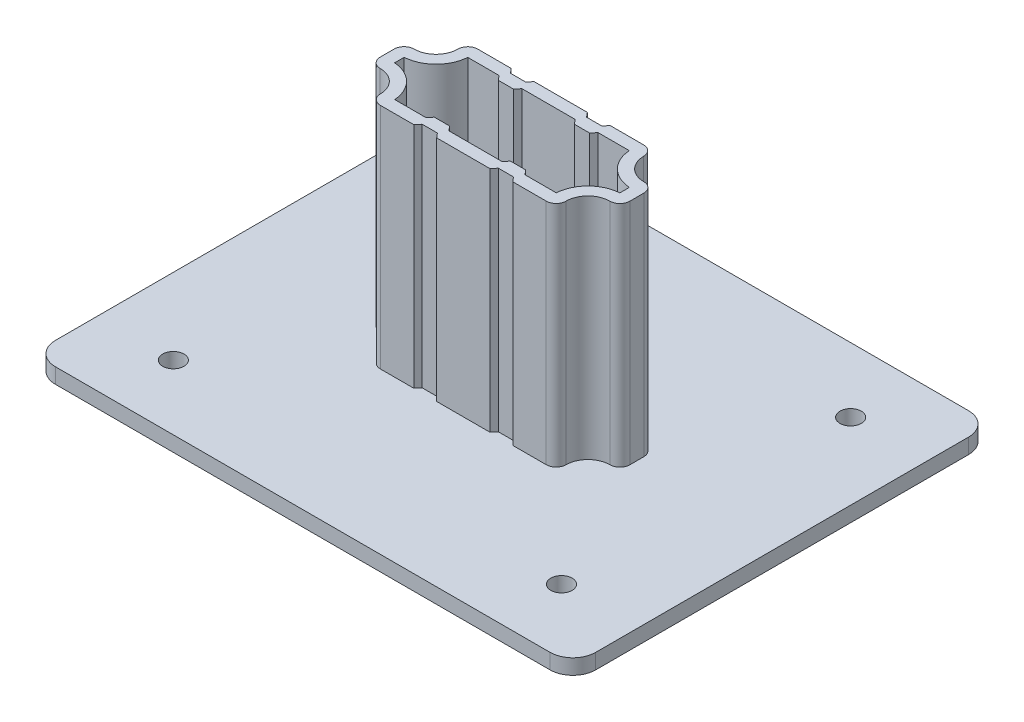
from build123d import *

# Parameters (mm, degrees)
SALIENTE_EXTRUIR1_DEPTH = 150
CROQUIS3_W              = 355
CROQUIS3_H              = 275
SALIENTE_EXTRUIR4_DEPTH = 10
REDONDEO1_R             = 15
CROQUIS6_R              = 7
CORTAR_EXTRUIR1_DEPTH   = 10


with BuildPart() as part:
    # Croquis2 → Saliente-Extruir1 (new body)
    with BuildSketch(Plane(origin=(0, 0, 0), x_dir=(1, 0, 0), z_dir=(0, 1, 0))):
        with BuildLine():
            Line((-17.482701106, 32), (17.482701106, 32))
            Line((17.482701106, 32), (20, 29))
            Line((20, 29), (30, 29))
            Line((30, 29), (32.517298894, 32))
            Line((32.517298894, 32), (54.5, 32))
            ThreePointArc((54.5, 32), (59.096194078, 30.096194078), (61, 25.5))
            ThreePointArc((61, 25.5), (65.278886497, 15.305466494), (75.5, 11.090466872))
            ThreePointArc((75.5, 11.090466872), (80.096194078, 9.18666095), (82, 4.590466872))
            Line((82, 4.590466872), (82, -4.590466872))
            ThreePointArc((82, -4.590466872), (80.096194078, -9.18666095), (75.5, -11.090466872))
            ThreePointArc((75.5, -11.090466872), (65.278886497, -15.305466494), (61, -25.5))
            ThreePointArc((61, -25.5), (59.096194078, -30.096194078), (54.5, -32))
            Line((54.5, -32), (32.517298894, -32))
            Line((32.517298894, -32), (30, -29))
            Line((30, -29), (20, -29))
            Line((20, -29), (17.482701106, -32))
            Line((17.482701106, -32), (-17.482701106, -32))
            Line((-17.482701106, -32), (-20, -29))
            Line((-20, -29), (-30, -29))
            Line((-30, -29), (-32.517298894, -32))
            Line((-32.517298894, -32), (-54.5, -32))
            ThreePointArc((-54.5, -32), (-59.096194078, -30.096194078), (-61, -25.5))
            ThreePointArc((-61, -25.5), (-65.278886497, -15.305466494), (-75.5, -11.090466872))
            ThreePointArc((-75.5, -11.090466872), (-80.096194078, -9.18666095), (-82, -4.590466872))
            Line((-82, -4.590466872), (-82, 4.590466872))
            ThreePointArc((-82, 4.590466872), (-80.096194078, 9.18666095), (-75.5, 11.090466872))
            ThreePointArc((-75.5, 11.090466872), (-65.278886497, 15.305466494), (-61, 25.5))
            ThreePointArc((-61, 25.5), (-59.096194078, 30.096194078), (-54.5, 32))
            Line((-54.5, 32), (-32.517298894, 32))
            Line((-32.517298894, 32), (-30, 29))
            Line((-30, 29), (-20, 29))
            Line((-20, 29), (-17.482701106, 32))
        make_face()
        with BuildLine():
            Line((-17.482701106, -24), (17.482701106, -24))
            Line((17.482701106, -24), (20, -21))
            Line((20, -21), (30, -21))
            Line((30, -21), (32.517298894, -24))
            Line((32.517298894, -24), (53.05630352, -24))
            ThreePointArc((53.05630352, -24), (59.622291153, -9.648719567), (74, -3.140806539))
            Line((74, -3.140806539), (73.999584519, 3.134588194))
            ThreePointArc((73.999584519, 3.134588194), (59.617736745, 9.644459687), (53.050055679, 24))
            Line((53.050055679, 24), (32.517298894, 24))
            Line((32.517298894, 24), (30, 21))
            Line((30, 21), (20, 21))
            Line((20, 21), (17.482701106, 24))
            Line((17.482701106, 24), (-17.482701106, 24))
            Line((-17.482701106, 24), (-20, 21))
            Line((-20, 21), (-30, 21))
            Line((-30, 21), (-32.517298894, 24))
            Line((-32.517298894, 24), (-53.05630352, 24))
            ThreePointArc((-53.05630352, 24), (-59.622291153, 9.648719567), (-74, 3.140806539))
            Line((-74, 3.140806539), (-74, -3.140806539))
            ThreePointArc((-74, -3.140806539), (-59.622291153, -9.648719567), (-53.05630352, -24))
            Line((-53.05630352, -24), (-32.517298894, -24))
            Line((-32.517298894, -24), (-30, -21))
            Line((-30, -21), (-20, -21))
            Line((-20, -21), (-17.482701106, -24))
        make_face(mode=Mode.SUBTRACT)
    extrude(amount=SALIENTE_EXTRUIR1_DEPTH)

    # Croquis3 → Saliente-Extruir4 (add)
    with BuildSketch(Plane.XZ):
        Rectangle(CROQUIS3_W, CROQUIS3_H)
    extrude(amount=SALIENTE_EXTRUIR4_DEPTH)

    # Redondeo1
    redondeo1_edges = [part.edges().sort_by_distance(p)[0] for p in [
        (-177.5, -5, 137.5),
        (-177.5, -5, -137.5),
        (177.5, -5, -137.5),
        (177.5, -5, 137.5),
    ]]
    fillet(redondeo1_edges, radius=REDONDEO1_R)

    # Croquis6 → Cortar-Extruir1 (cut)
    with BuildSketch(Plane.XZ.offset(10)):
        with Locations(Location((-127.5, -95, 0), (0, 0, 270))):
            Circle(CROQUIS6_R)
        with Locations(Location((127.5, -95, 0), (0, 0, 270))):
            Circle(CROQUIS6_R)
        with Locations(Location((127.5, 95, 0), (0, 0, 90))):
            Circle(CROQUIS6_R)
        with Locations(Location((-127.5, 95, 0), (0, 0, 90))):
            Circle(CROQUIS6_R)
    extrude(amount=-CORTAR_EXTRUIR1_DEPTH, mode=Mode.SUBTRACT)


solid = part.part
